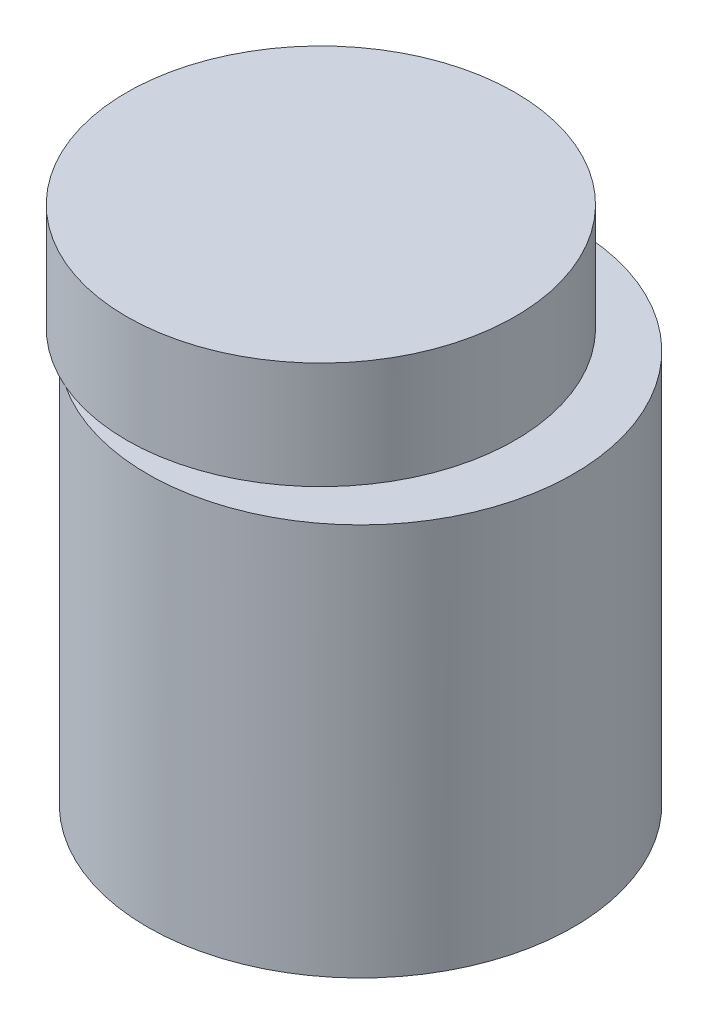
ISO-10303-21;
HEADER;
FILE_DESCRIPTION(('STEP AP214'),'2;1');
FILE_NAME('part.step','',(''),(''),'','','');
FILE_SCHEMA(('AUTOMOTIVE_DESIGN { 1 0 10303 214 1 1 1 1 }'));
ENDSEC;
DATA;
#1=APPLICATION_CONTEXT('core data for automotive mechanical design processes');
#2=APPLICATION_PROTOCOL_DEFINITION('international standard','automotive_design',2000,#1);
#3=PRODUCT_CONTEXT('',#1,'mechanical');
#4=PRODUCT('Part','Part','',(#3));
#5=PRODUCT_RELATED_PRODUCT_CATEGORY('part','',(#4));
#6=PRODUCT_DEFINITION_FORMATION('','',#4);
#7=PRODUCT_DEFINITION_CONTEXT('part definition',#1,'design');
#8=PRODUCT_DEFINITION('design','',#6,#7);
#9=PRODUCT_DEFINITION_SHAPE('','',#8);
#10=(LENGTH_UNIT() NAMED_UNIT(*) SI_UNIT(.MILLI.,.METRE.));
#11=(NAMED_UNIT(*) PLANE_ANGLE_UNIT() SI_UNIT($,.RADIAN.));
#12=(NAMED_UNIT(*) SI_UNIT($,.STERADIAN.) SOLID_ANGLE_UNIT());
#13=UNCERTAINTY_MEASURE_WITH_UNIT(LENGTH_MEASURE(1.E-05),#10,'distance_accuracy_value','');
#14=(GEOMETRIC_REPRESENTATION_CONTEXT(3) GLOBAL_UNCERTAINTY_ASSIGNED_CONTEXT((#13)) GLOBAL_UNIT_ASSIGNED_CONTEXT((#10,
#11,#12)) REPRESENTATION_CONTEXT('',''));
#15=CARTESIAN_POINT('',(0.,0.,0.));
#16=DIRECTION('',(0.,0.,1.));
#17=DIRECTION('',(1.,0.,0.));
#18=AXIS2_PLACEMENT_3D('',#15,#16,#17);
#19=CARTESIAN_POINT('',(0.,10.,0.));
#20=DIRECTION('',(0.,-1.,0.));
#21=DIRECTION('',(0.,0.,-1.));
#22=AXIS2_PLACEMENT_3D('',#19,#20,#21);
#23=CYLINDRICAL_SURFACE('',#22,5.375);
#24=CARTESIAN_POINT('',(0.,10.,0.));
#25=DIRECTION('',(0.,1.,0.));
#26=DIRECTION('',(0.,0.,1.));
#27=AXIS2_PLACEMENT_3D('',#24,#25,#26);
#28=CIRCLE('',#27,5.375);
#29=CARTESIAN_POINT('',(-2.94031249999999,10.,-4.49946523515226));
#30=VERTEX_POINT('',#29);
#31=CARTESIAN_POINT('',(-2.94031249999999,10.,4.49946523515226));
#32=VERTEX_POINT('',#31);
#33=EDGE_CURVE('E106',#30,#32,#28,.T.);
#34=ORIENTED_EDGE('',*,*,#33,.F.);
#35=EDGE_CURVE('E103',#32,#30,#28,.T.);
#36=ORIENTED_EDGE('',*,*,#35,.F.);
#37=EDGE_LOOP('',(#34,#36));
#38=FACE_BOUND('',#37,.T.);
#39=CARTESIAN_POINT('',(0.,0.100000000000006,0.));
#40=DIRECTION('',(0.,-1.,0.));
#41=DIRECTION('',(0.,0.,-1.));
#42=AXIS2_PLACEMENT_3D('',#39,#40,#41);
#43=CIRCLE('',#42,5.375);
#44=CARTESIAN_POINT('',(0.,0.100000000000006,-5.375));
#45=VERTEX_POINT('',#44);
#46=EDGE_CURVE('E85',#45,#45,#43,.T.);
#47=ORIENTED_EDGE('',*,*,#46,.F.);
#48=EDGE_LOOP('',(#47));
#49=FACE_BOUND('',#48,.T.);
#50=ADVANCED_FACE('F44',(#38,#49),#23,.T.);
#51=CARTESIAN_POINT('',(0.,10.,0.));
#52=DIRECTION('',(0.,1.,0.));
#53=DIRECTION('',(0.,0.,1.));
#54=AXIS2_PLACEMENT_3D('',#51,#52,#53);
#55=PLANE('',#54);
#56=CARTESIAN_POINT('',(-1.,10.,0.));
#57=DIRECTION('',(0.,1.,0.));
#58=DIRECTION('',(0.,0.,1.));
#59=AXIS2_PLACEMENT_3D('',#56,#57,#58);
#60=CIRCLE('',#59,4.9);
#61=EDGE_CURVE('E52',#32,#30,#60,.T.);
#62=ORIENTED_EDGE('',*,*,#61,.F.);
#63=ORIENTED_EDGE('',*,*,#35,.T.);
#64=EDGE_LOOP('',(#62,#63));
#65=FACE_BOUND('',#64,.T.);
#66=ADVANCED_FACE('F117',(#65),#55,.T.);
#67=CARTESIAN_POINT('',(-1.,10.,0.));
#68=DIRECTION('',(0.,1.,0.));
#69=DIRECTION('',(0.,0.,1.));
#70=AXIS2_PLACEMENT_3D('',#67,#68,#69);
#71=PLANE('',#70);
#72=EDGE_CURVE('E94',#30,#32,#60,.T.);
#73=ORIENTED_EDGE('',*,*,#72,.F.);
#74=ORIENTED_EDGE('',*,*,#33,.T.);
#75=EDGE_LOOP('',(#73,#74));
#76=FACE_BOUND('',#75,.T.);
#77=ADVANCED_FACE('F121',(#76),#71,.F.);
#78=CARTESIAN_POINT('',(-1.,12.7,0.));
#79=DIRECTION('',(0.,-1.,0.));
#80=DIRECTION('',(0.,0.,-1.));
#81=AXIS2_PLACEMENT_3D('',#78,#79,#80);
#82=CYLINDRICAL_SURFACE('',#81,4.9);
#83=CARTESIAN_POINT('',(-1.,12.7,0.));
#84=DIRECTION('',(0.,1.,0.));
#85=DIRECTION('',(0.,0.,1.));
#86=AXIS2_PLACEMENT_3D('',#83,#84,#85);
#87=CIRCLE('',#86,4.9);
#88=CARTESIAN_POINT('',(-1.,12.7,4.9));
#89=VERTEX_POINT('',#88);
#90=EDGE_CURVE('E99',#89,#89,#87,.T.);
#91=ORIENTED_EDGE('',*,*,#90,.F.);
#92=EDGE_LOOP('',(#91));
#93=FACE_BOUND('',#92,.T.);
#94=ORIENTED_EDGE('',*,*,#72,.T.);
#95=ORIENTED_EDGE('',*,*,#61,.T.);
#96=EDGE_LOOP('',(#94,#95));
#97=FACE_BOUND('',#96,.T.);
#98=ADVANCED_FACE('F120',(#93,#97),#82,.T.);
#99=CARTESIAN_POINT('',(-1.,12.7,0.));
#100=DIRECTION('',(0.,1.,0.));
#101=DIRECTION('',(0.,0.,1.));
#102=AXIS2_PLACEMENT_3D('',#99,#100,#101);
#103=PLANE('',#102);
#104=ORIENTED_EDGE('',*,*,#90,.T.);
#105=EDGE_LOOP('',(#104));
#106=FACE_BOUND('',#105,.T.);
#107=ADVANCED_FACE('F128',(#106),#103,.T.);
#108=CARTESIAN_POINT('',(0.,0.100000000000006,0.));
#109=DIRECTION('',(0.,-1.,0.));
#110=DIRECTION('',(0.,0.,-1.));
#111=AXIS2_PLACEMENT_3D('',#108,#109,#110);
#112=PLANE('',#111);
#113=CARTESIAN_POINT('',(-1.,0.100000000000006,0.));
#114=DIRECTION('',(0.,-1.,0.));
#115=DIRECTION('',(0.,0.,-1.));
#116=AXIS2_PLACEMENT_3D('',#113,#114,#115);
#117=CIRCLE('',#116,2.6);
#118=CARTESIAN_POINT('',(1.05,0.100000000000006,-1.59921855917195));
#119=VERTEX_POINT('',#118);
#120=CARTESIAN_POINT('',(1.05,0.100000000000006,1.59921855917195));
#121=VERTEX_POINT('',#120);
#122=EDGE_CURVE('E57',#119,#121,#117,.F.);
#123=ORIENTED_EDGE('',*,*,#122,.T.);
#124=DIRECTION('',(0.,0.,-1.));
#125=VECTOR('',#124,1.);
#126=CARTESIAN_POINT('',(1.05,0.100000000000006,1.59921855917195));
#127=LINE('',#126,#125);
#128=EDGE_CURVE('E11',#121,#119,#127,.T.);
#129=ORIENTED_EDGE('',*,*,#128,.T.);
#130=EDGE_LOOP('',(#123,#129));
#131=FACE_BOUND('',#130,.T.);
#132=ORIENTED_EDGE('',*,*,#46,.T.);
#133=EDGE_LOOP('',(#132));
#134=FACE_BOUND('',#133,.T.);
#135=ADVANCED_FACE('F75',(#131,#134),#112,.T.);
#136=CARTESIAN_POINT('',(-1.,7.1,0.));
#137=DIRECTION('',(0.,-1.,0.));
#138=DIRECTION('',(0.,0.,-1.));
#139=AXIS2_PLACEMENT_3D('',#136,#137,#138);
#140=PLANE('',#139);
#141=CARTESIAN_POINT('',(-1.,7.1,0.));
#142=DIRECTION('',(0.,-1.,0.));
#143=DIRECTION('',(0.,0.,-1.));
#144=AXIS2_PLACEMENT_3D('',#141,#142,#143);
#145=CIRCLE('',#144,2.6);
#146=CARTESIAN_POINT('',(1.05,7.1,1.59921855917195));
#147=VERTEX_POINT('',#146);
#148=CARTESIAN_POINT('',(1.05,7.1,-1.59921855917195));
#149=VERTEX_POINT('',#148);
#150=EDGE_CURVE('E90',#147,#149,#145,.T.);
#151=ORIENTED_EDGE('',*,*,#150,.T.);
#152=DIRECTION('',(0.,0.,-1.));
#153=VECTOR('',#152,1.);
#154=CARTESIAN_POINT('',(1.05,7.1,1.59921855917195));
#155=LINE('',#154,#153);
#156=EDGE_CURVE('E88',#147,#149,#155,.T.);
#157=ORIENTED_EDGE('',*,*,#156,.F.);
#158=EDGE_LOOP('',(#151,#157));
#159=FACE_BOUND('',#158,.T.);
#160=ADVANCED_FACE('F142',(#159),#140,.T.);
#161=CARTESIAN_POINT('',(1.05,-7.9,1.59921855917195));
#162=DIRECTION('',(1.,0.,0.));
#163=DIRECTION('',(0.,0.,-1.));
#164=AXIS2_PLACEMENT_3D('',#161,#162,#163);
#165=PLANE('',#164);
#166=ORIENTED_EDGE('',*,*,#128,.F.);
#167=DIRECTION('',(0.,1.,0.));
#168=VECTOR('',#167,1.);
#169=CARTESIAN_POINT('',(1.05,-7.9,1.59921855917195));
#170=LINE('',#169,#168);
#171=EDGE_CURVE('E64',#121,#147,#170,.T.);
#172=ORIENTED_EDGE('',*,*,#171,.T.);
#173=ORIENTED_EDGE('',*,*,#156,.T.);
#174=DIRECTION('',(0.,-1.,0.));
#175=VECTOR('',#174,1.);
#176=CARTESIAN_POINT('',(1.05,7.1,-1.59921855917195));
#177=LINE('',#176,#175);
#178=EDGE_CURVE('E82',#149,#119,#177,.T.);
#179=ORIENTED_EDGE('',*,*,#178,.T.);
#180=EDGE_LOOP('',(#166,#172,#173,#179));
#181=FACE_BOUND('',#180,.T.);
#182=ADVANCED_FACE('F87',(#181),#165,.F.);
#183=CARTESIAN_POINT('',(-1.,7.1,0.));
#184=DIRECTION('',(0.,-1.,0.));
#185=DIRECTION('',(0.,0.,-1.));
#186=AXIS2_PLACEMENT_3D('',#183,#184,#185);
#187=CYLINDRICAL_SURFACE('',#186,2.6);
#188=ORIENTED_EDGE('',*,*,#122,.F.);
#189=ORIENTED_EDGE('',*,*,#178,.F.);
#190=ORIENTED_EDGE('',*,*,#150,.F.);
#191=ORIENTED_EDGE('',*,*,#171,.F.);
#192=EDGE_LOOP('',(#188,#189,#190,#191));
#193=FACE_BOUND('',#192,.T.);
#194=ADVANCED_FACE('F80',(#193),#187,.F.);
#195=CLOSED_SHELL('',(#50,#66,#77,#98,#107,#135,#160,#182,#194));
#196=MANIFOLD_SOLID_BREP('B2',#195);
#197=ADVANCED_BREP_SHAPE_REPRESENTATION('',(#18,#196),#14);
#198=SHAPE_DEFINITION_REPRESENTATION(#9,#197);
ENDSEC;
END-ISO-10303-21;
